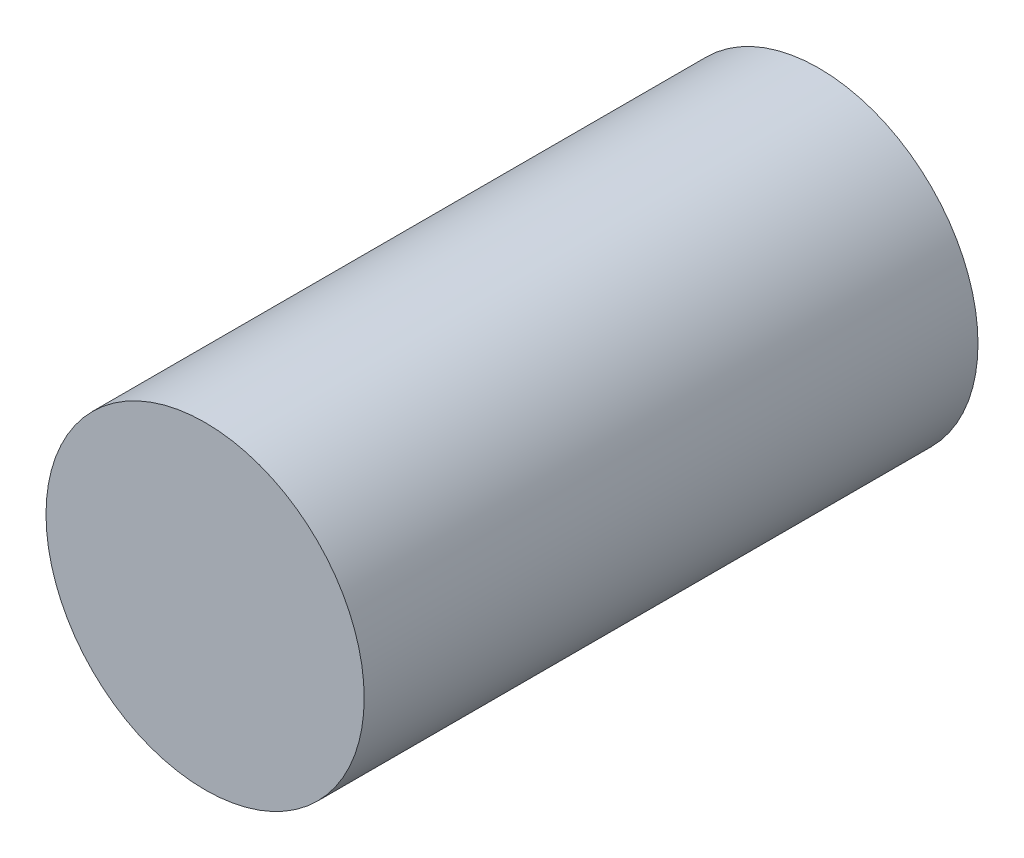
from build123d import *

# Parameters (mm, degrees)
ESQUISSE1_R          = 5
BASE_EXTRUSION_DEPTH = 19.29


with BuildPart() as part:
    # Esquisse1 → Base-Extrusion (new body)
    with BuildSketch(Plane.XY):
        with Locations((-50, 50)):
            Circle(ESQUISSE1_R)
    extrude(amount=BASE_EXTRUSION_DEPTH)


solid = part.part
